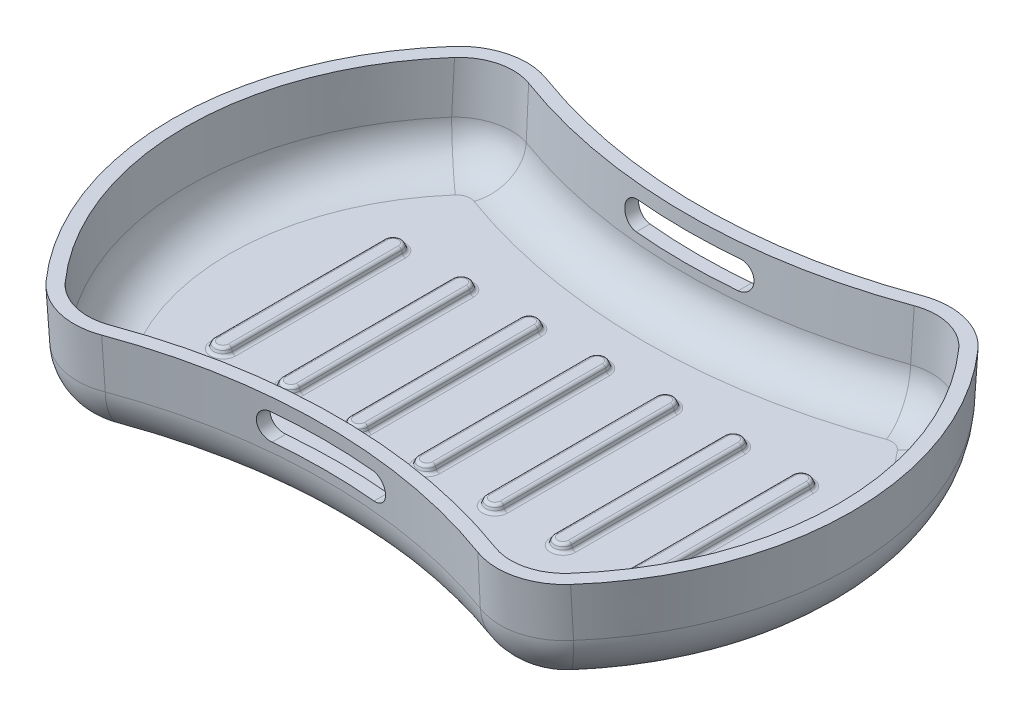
from build123d import *

# Parameters (mm, degrees)
BOSS_EXTRUDE1_DEPTH           = 15
BOSS_EXTRUDE1_DRAFT           = -3
FILLET3_R                     = 10
FILLET4_R                     = 8
SHELL1_T                      = -2
SKETCH2_R                     = 2.5
BOSS_EXTRUDE2_DEPTH           = 1
BOSS_EXTRUDE2_DRAFT           = 3
BOSS_EXTRUDE2_PROFILE_2_DEPTH = 1
BOSS_EXTRUDE2_PROFILE_2_DRAFT = 3
BOSS_EXTRUDE2_PROFILE_3_DEPTH = 1
BOSS_EXTRUDE2_PROFILE_3_DRAFT = 3
BOSS_EXTRUDE2_PROFILE_4_DEPTH = 1
BOSS_EXTRUDE2_PROFILE_4_DRAFT = 3
FILLET5_R                     = 0.25
BOSS_EXTRUDE3_DEPTH           = 1
BOSS_EXTRUDE3_TAPER           = 20
FILLET6_R                     = 0.5
LPATTERN1_COUNT               = 7
LPATTERN1_PITCH               = 10
FILLET6_OF_LPATTERN1_R        = 0.5
CUT_EXTRUDE1_DEPTH            = 63.168861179
CUT_EXTRUDE1_DEPTH_BACK       = 63.168861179


with BuildPart() as part:
    # Sketch1 → Boss-Extrude1 (with draft: the straight prism first)
    with BuildSketch(Plane(origin=(0, 0, 0), x_dir=(1, 0, 0), z_dir=(0, 1, 0))):
        with BuildLine():
            ThreePointArc((-33.284271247, -35), (0, -27.747214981), (33.284271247, -35))
            ThreePointArc((33.284271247, -35), (50, 0), (33.284271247, 35))
            ThreePointArc((33.284271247, 35), (0, 27.747214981), (-33.284271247, 35))
            ThreePointArc((-33.284271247, 35), (-50, 0), (-33.284271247, -35))
        make_face()
    extrude(amount=-BOSS_EXTRUDE1_DEPTH)
    # Boss-Extrude1: the draft: its side faces are tilted about the plane it starts from
    boss_extrude1_sides = [part.faces().sort_by_distance(p)[0] for p in [
        (50, -7.5, 0),
        (0, -7.5, -27.747214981),
        (-50, -7.5, 0),
        (0, -7.5, 27.747214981),
    ]]
    draft(boss_extrude1_sides, Plane(origin=(0, 0, 0), x_dir=(1, 0, 0), z_dir=(0, 1, 0)), BOSS_EXTRUDE1_DRAFT)

    # Fillet3
    fillet3_edges = [part.edges().sort_by_distance(p)[0] for p in [
        (33.225509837, -7.500010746, -34.541276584),
        (33.225509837, -7.500010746, 34.541276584),
        (-33.225509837, -7.500010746, 34.541276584),
        (-33.225509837, -7.500010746, -34.541276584),
    ]]
    fillet(fillet3_edges, radius=FILLET3_R)

    # Fillet4
    fillet4_edges = [part.edges().sort_by_distance(p)[0] for p in [
        (-33.40874709, -15, 32.054923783),
        (0, -15, 26.961098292),
        (33.40874709, -15, 32.054923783),
        (49.213883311, -15, 0),
        (33.40874709, -15, -32.054923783),
        (0, -15, -26.961098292),
        (-33.40874709, -15, -32.054923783),
        (-49.213883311, -15, 0),
    ]]
    fillet(fillet4_edges, radius=FILLET4_R)

    # Shell1
    shell1_openings = [part.faces().sort_by_distance(p)[0] for p in [
        (1e-09, 0, 1e-09),
    ]]
    offset(amount=SHELL1_T, openings=shell1_openings)


with BuildPart() as boss_extrude2_tool:
    # Sketch2 → Boss-Extrude2 (with draft: the straight prism first)
    with BuildSketch(Plane.XZ.offset(15)):
        with Locations((30, 20)):
            Circle(SKETCH2_R)
    extrude(amount=BOSS_EXTRUDE2_DEPTH)
    # Boss-Extrude2: the draft: its side faces are tilted about the plane it starts from
    boss_extrude2_sides = [boss_extrude2_tool.faces().sort_by_distance(p)[0] for p in [
        (27.5, -15.5, 20),
    ]]
    draft(boss_extrude2_sides, Plane.XZ.offset(15), BOSS_EXTRUDE2_DRAFT)


with BuildPart() as part_1:
    add(part.part)

    # Boss-Extrude2: add boss_extrude2_tool
    add(boss_extrude2_tool.part)


with BuildPart() as boss_extrude2_profile_2_tool:
    # Sketch2 → Boss-Extrude2 profile 2 (with draft: the straight prism first)
    with BuildSketch(Plane.XZ.offset(15)):
        with Locations((30, -20)):
            Circle(SKETCH2_R)
    extrude(amount=BOSS_EXTRUDE2_PROFILE_2_DEPTH)
    # Boss-Extrude2 profile 2: the draft: its side faces are tilted about the plane it starts from
    boss_extrude2_profile_2_sides = [boss_extrude2_profile_2_tool.faces().sort_by_distance(p)[0] for p in [
        (27.5, -15.5, -20),
    ]]
    draft(boss_extrude2_profile_2_sides, Plane.XZ.offset(15), BOSS_EXTRUDE2_PROFILE_2_DRAFT)


with BuildPart() as part_2:
    add(part_1.part)

    # Boss-Extrude2 profile 2: add boss_extrude2_profile_2_tool
    add(boss_extrude2_profile_2_tool.part)


with BuildPart() as boss_extrude2_profile_3_tool:
    # Sketch2 → Boss-Extrude2 profile 3 (with draft: the straight prism first)
    with BuildSketch(Plane.XZ.offset(15)):
        with Locations((-30, 20)):
            Circle(SKETCH2_R)
    extrude(amount=BOSS_EXTRUDE2_PROFILE_3_DEPTH)
    # Boss-Extrude2 profile 3: the draft: its side faces are tilted about the plane it starts from
    boss_extrude2_profile_3_sides = [boss_extrude2_profile_3_tool.faces().sort_by_distance(p)[0] for p in [
        (-32.5, -15.5, 20),
    ]]
    draft(boss_extrude2_profile_3_sides, Plane.XZ.offset(15), BOSS_EXTRUDE2_PROFILE_3_DRAFT)


with BuildPart() as part_3:
    add(part_2.part)

    # Boss-Extrude2 profile 3: add boss_extrude2_profile_3_tool
    add(boss_extrude2_profile_3_tool.part)


with BuildPart() as boss_extrude2_profile_4_tool:
    # Sketch2 → Boss-Extrude2 profile 4 (with draft: the straight prism first)
    with BuildSketch(Plane.XZ.offset(15)):
        with Locations((-30, -20)):
            Circle(SKETCH2_R)
    extrude(amount=BOSS_EXTRUDE2_PROFILE_4_DEPTH)
    # Boss-Extrude2 profile 4: the draft: its side faces are tilted about the plane it starts from
    boss_extrude2_profile_4_sides = [boss_extrude2_profile_4_tool.faces().sort_by_distance(p)[0] for p in [
        (-32.5, -15.5, -20),
    ]]
    draft(boss_extrude2_profile_4_sides, Plane.XZ.offset(15), BOSS_EXTRUDE2_PROFILE_4_DRAFT)


with BuildPart() as part_4:
    add(part_3.part)

    # Boss-Extrude2 profile 4: add boss_extrude2_profile_4_tool
    add(boss_extrude2_profile_4_tool.part)

    # Fillet5
    fillet5_edges = [part_4.edges().sort_by_distance(p)[0] for p in [
        (27.5, -15, 20),
        (27.552407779, -16, 20),
        (27.5, -15, -20),
        (27.552407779, -16, -20),
        (-32.5, -15, 20),
        (-32.447592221, -16, 20),
        (-32.5, -15, -20),
        (-32.447592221, -16, -20),
    ]]
    fillet(fillet5_edges, radius=FILLET5_R)

    # Sketch3 → Boss-Extrude3 (add)
    with BuildSketch(Plane(origin=(0, -13, 0), x_dir=(1, 0, 0), z_dir=(0, 1, 0))):
        with BuildLine():
            ThreePointArc((-31.5, -12.5), (-30, -14), (-28.5, -12.5))
            Line((-28.5, -12.5), (-28.5, 12.5))
            ThreePointArc((-28.5, 12.5), (-30, 14), (-31.5, 12.5))
            Line((-31.5, 12.5), (-31.5, -12.5))
        make_face()
    boss_extrude3 = extrude(amount=BOSS_EXTRUDE3_DEPTH, taper=BOSS_EXTRUDE3_TAPER)

    # Fillet6
    fillet6_edges = [part_4.edges().sort_by_distance(p)[0] for p in [
        (-30, -13, 14),
        (-28.5, -13, 0),
        (-30, -13, -14),
        (-31.5, -13, 0),
        (-30, -12, 13.636029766),
        (-28.863970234, -12, 0),
        (-30, -12, -13.636029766),
        (-31.136029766, -12, 0),
    ]]
    fillet(fillet6_edges, radius=FILLET6_R)

    # LPattern1: Boss-Extrude3 ×7
    with Locations(*[(i * LPATTERN1_PITCH, 0, 0) for i in range(1, LPATTERN1_COUNT)]):
        add(boss_extrude3)

    # Fillet6 of LPattern1
    fillet6_of_lpattern1_edges = [part_4.edges().sort_by_distance(p)[0] for p in [
        (-20, -13, 14),
        (-18.5, -13, 0),
        (-20, -13, -14),
        (-21.5, -13, 0),
        (-20, -12, 13.636029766),
        (-18.863970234, -12, 0),
        (-20, -12, -13.636029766),
        (-21.136029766, -12, 0),
        (-10, -13, 14),
        (-8.5, -13, 0),
        (-10, -13, -14),
        (-11.5, -13, 0),
        (-10, -12, 13.636029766),
        (-8.863970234, -12, 0),
        (-10, -12, -13.636029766),
        (-11.136029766, -12, 0),
        (0, -13, 14),
        (1.5, -13, 0),
        (0, -13, -14),
        (-1.5, -13, 0),
        (0, -12, 13.636029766),
        (1.136029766, -12, 0),
        (0, -12, -13.636029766),
        (-1.136029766, -12, 0),
        (10, -13, 14),
        (11.5, -13, 0),
        (10, -13, -14),
        (8.5, -13, 0),
        (10, -12, 13.636029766),
        (11.136029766, -12, 0),
        (10, -12, -13.636029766),
        (8.863970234, -12, 0),
        (20, -13, 14),
        (21.5, -13, 0),
        (20, -13, -14),
        (18.5, -13, 0),
        (20, -12, 13.636029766),
        (21.136029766, -12, 0),
        (20, -12, -13.636029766),
        (18.863970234, -12, 0),
        (30, -13, 14),
        (31.5, -13, 0),
        (30, -13, -14),
        (28.5, -13, 0),
        (30, -12, 13.636029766),
        (31.136029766, -12, 0),
        (30, -12, -13.636029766),
        (28.863970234, -12, 0),
    ]]
    fillet(fillet6_of_lpattern1_edges, radius=FILLET6_OF_LPATTERN1_R)

    # Sketch5 → Cut-Extrude1 (cut, two sides: drawn at the far end of the back side and taken through both)
    with BuildSketch(Plane.XY.offset(-CUT_EXTRUDE1_DEPTH_BACK)):
        with BuildLine():
            Line((-7.5, -2), (7.5, -2))
            ThreePointArc((7.5, -2), (9.5, -4), (7.5, -6))
            Line((7.5, -6), (-7.5, -6))
            ThreePointArc((-7.5, -6), (-9.5, -4), (-7.5, -2))
        make_face()
    extrude(amount=CUT_EXTRUDE1_DEPTH + CUT_EXTRUDE1_DEPTH_BACK, mode=Mode.SUBTRACT)


solid = part_4.part
